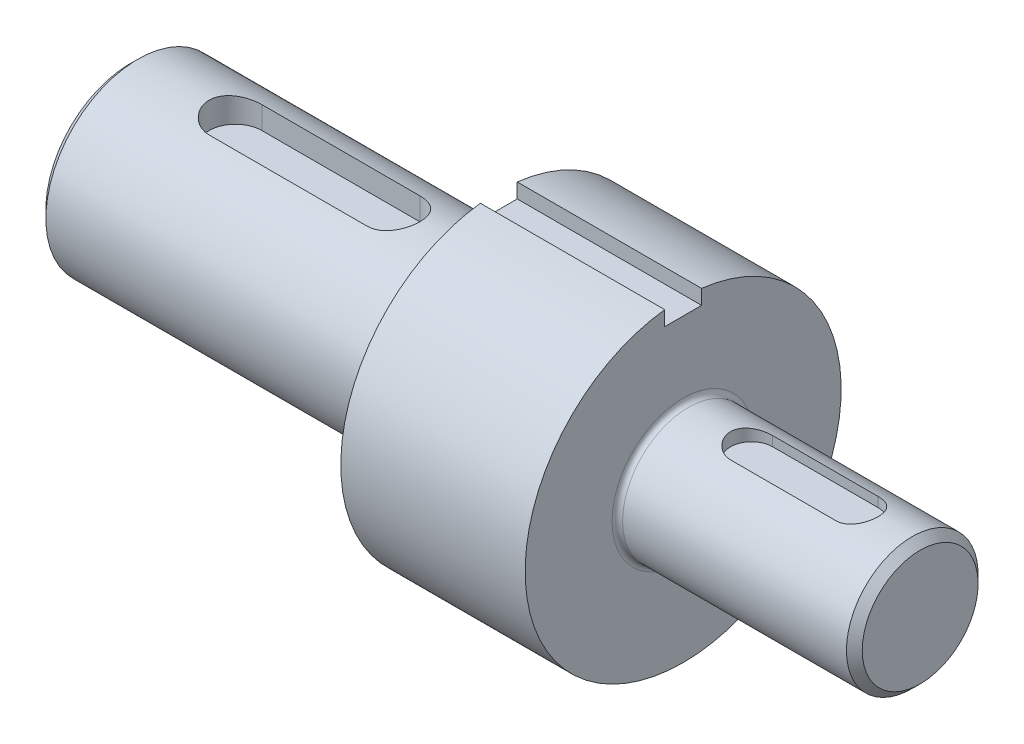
from build123d import *

# Parameters (mm, degrees)
SKIZZE3_W                       = 7
SKIZZE3_H                       = 6
SCHNITT_LINEAR_AUSTRAGEN1_DEPTH = 114.247516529
SCHNITT_LINEAR_START            = 10
SCHNITT_LINEAR_AUSTRAGEN2_DEPTH = 146.884572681
FASE1_SIZE                      = 1.5
VERRUNDUNG1_R                   = 1
SCHNITT_LINEAR_START_2          = 12.5
SCHNITT_LINEAR_AUSTRAGEN3_DEPTH = 144.384572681
FASE2_SIZE                      = 1.5
VERRUNDUNG2_R                   = 1


with BuildPart() as part:
    # Skizze1 → Rotation1 (revolve)
    with BuildSketch(Plane.XY, mode=Mode.PRIVATE) as rotation1_sk:
        Polygon((0, 0), (0, 17.5), (70, 17.5), (70, 30), (105, 30), (105, 12.5), (150, 12.5), (150, 0), align=None)
    revolve(rotation1_sk.sketch.rotate(Axis((0, 0, 0), (1, 0, 0)), 90), axis=Axis((0, 0, 0), (1, 0, 0)))

    # Skizze3 → Schnitt-Linear austragen1 (cut, through all)
    with BuildSketch(Plane(origin=(105, 0, 0), x_dir=(0, 0, -1), z_dir=(1, 0, 0))):
        with Locations((0, 30)):
            Rectangle(SKIZZE3_W, SKIZZE3_H)
    extrude(amount=-SCHNITT_LINEAR_AUSTRAGEN1_DEPTH, mode=Mode.SUBTRACT)

    # Skizze4 → Schnitt-Linear austragen2 (cut, through all)
    with BuildSketch(Plane(origin=(0, 0, 0), x_dir=(1, 0, 0), z_dir=(0, 1, 0)).offset(SCHNITT_LINEAR_START)):
        with BuildLine():
            Line((118, 4), (138, 4))
            ThreePointArc((138, 4), (142, 0), (138, -4))
            Line((138, -4), (118, -4))
            ThreePointArc((118, -4), (114, 0), (118, 4))
        make_face()
    extrude(amount=SCHNITT_LINEAR_AUSTRAGEN2_DEPTH, mode=Mode.SUBTRACT)

    # Fase1
    fase1_edges = [part.edges().sort_by_distance(p)[0] for p in [
        (150, 0, -12.5),
    ]]
    chamfer(fase1_edges, length=FASE1_SIZE)

    # Verrundung1
    verrundung1_edges = [part.edges().sort_by_distance(p)[0] for p in [
        (105, 0, -12.5),
    ]]
    fillet(verrundung1_edges, radius=VERRUNDUNG1_R)

    # Skizze5 → Schnitt-Linear austragen3 (cut, through all)
    with BuildSketch(Plane(origin=(0, 0, 0), x_dir=(1, 0, 0), z_dir=(0, 1, 0)).offset(SCHNITT_LINEAR_START_2)):
        with BuildLine():
            Line((20, 5), (50, 5))
            ThreePointArc((50, 5), (55, 0), (50, -5))
            Line((50, -5), (20, -5))
            ThreePointArc((20, -5), (15, 0), (20, 5))
        make_face()
    extrude(amount=SCHNITT_LINEAR_AUSTRAGEN3_DEPTH, mode=Mode.SUBTRACT)

    # Fase2
    fase2_edges = [part.edges().sort_by_distance(p)[0] for p in [
        (0, 0, -17.5),
    ]]
    chamfer(fase2_edges, length=FASE2_SIZE)

    # Verrundung2
    verrundung2_edges = [part.edges().sort_by_distance(p)[0] for p in [
        (70, 0, -17.5),
    ]]
    fillet(verrundung2_edges, radius=VERRUNDUNG2_R)


solid = part.part
